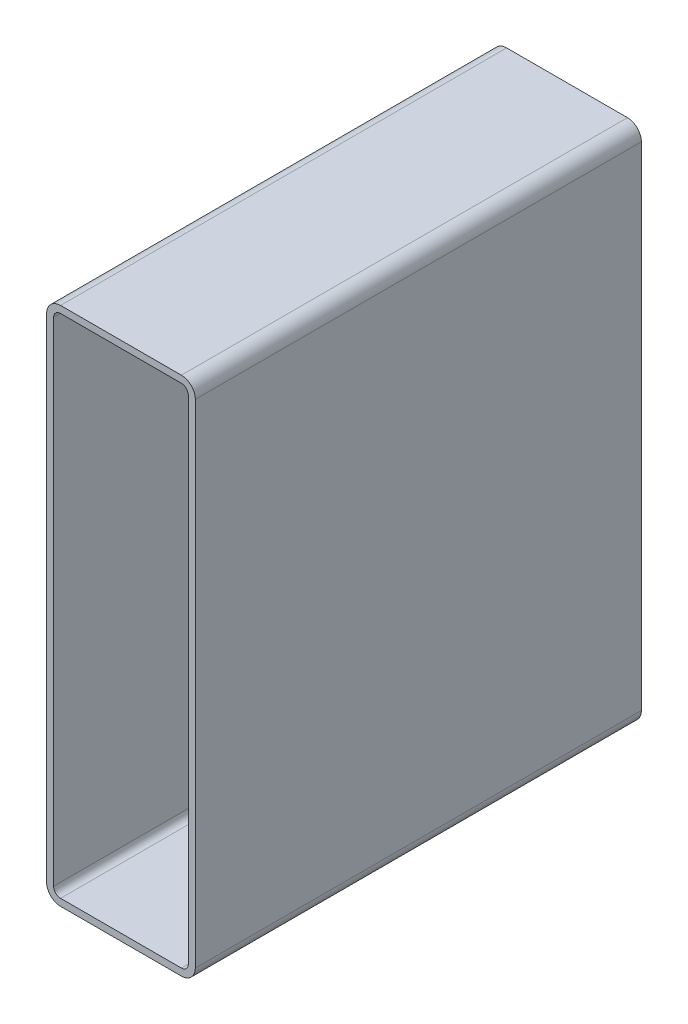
ISO-10303-21;
HEADER;
FILE_DESCRIPTION(('STEP AP214'),'2;1');
FILE_NAME('part.step','',(''),(''),'','','');
FILE_SCHEMA(('AUTOMOTIVE_DESIGN { 1 0 10303 214 1 1 1 1 }'));
ENDSEC;
DATA;
#1=APPLICATION_CONTEXT('core data for automotive mechanical design processes');
#2=APPLICATION_PROTOCOL_DEFINITION('international standard','automotive_design',2000,#1);
#3=PRODUCT_CONTEXT('',#1,'mechanical');
#4=PRODUCT('Part','Part','',(#3));
#5=PRODUCT_RELATED_PRODUCT_CATEGORY('part','',(#4));
#6=PRODUCT_DEFINITION_FORMATION('','',#4);
#7=PRODUCT_DEFINITION_CONTEXT('part definition',#1,'design');
#8=PRODUCT_DEFINITION('design','',#6,#7);
#9=PRODUCT_DEFINITION_SHAPE('','',#8);
#10=(LENGTH_UNIT() NAMED_UNIT(*) SI_UNIT(.MILLI.,.METRE.));
#11=(NAMED_UNIT(*) PLANE_ANGLE_UNIT() SI_UNIT($,.RADIAN.));
#12=(NAMED_UNIT(*) SI_UNIT($,.STERADIAN.) SOLID_ANGLE_UNIT());
#13=UNCERTAINTY_MEASURE_WITH_UNIT(LENGTH_MEASURE(1.E-05),#10,'distance_accuracy_value','');
#14=(GEOMETRIC_REPRESENTATION_CONTEXT(3) GLOBAL_UNCERTAINTY_ASSIGNED_CONTEXT((#13)) GLOBAL_UNIT_ASSIGNED_CONTEXT((#10,
#11,#12)) REPRESENTATION_CONTEXT('',''));
#15=CARTESIAN_POINT('',(0.,0.,0.));
#16=DIRECTION('',(0.,0.,1.));
#17=DIRECTION('',(1.,0.,0.));
#18=AXIS2_PLACEMENT_3D('',#15,#16,#17);
#19=CARTESIAN_POINT('',(11.2001778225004,347.903679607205,304.8));
#20=DIRECTION('',(0.,0.,1.));
#21=DIRECTION('',(1.,0.,0.));
#22=AXIS2_PLACEMENT_3D('',#19,#20,#21);
#23=PLANE('',#22);
#24=CARTESIAN_POINT('',(11.2001778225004,347.903679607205,304.8));
#25=DIRECTION('',(0.,0.,1.));
#26=DIRECTION('',(1.,0.,0.));
#27=AXIS2_PLACEMENT_3D('',#24,#25,#26);
#28=CIRCLE('',#27,9.52500000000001);
#29=CARTESIAN_POINT('',(11.2001778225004,357.428679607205,304.8));
#30=VERTEX_POINT('',#29);
#31=CARTESIAN_POINT('',(1.67517782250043,347.903679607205,304.8));
#32=VERTEX_POINT('',#31);
#33=EDGE_CURVE('E211',#30,#32,#28,.T.);
#34=ORIENTED_EDGE('',*,*,#33,.T.);
#35=DIRECTION('',(0.,-1.,0.));
#36=VECTOR('',#35,1.);
#37=CARTESIAN_POINT('',(1.67517782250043,11.3536796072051,304.8));
#38=LINE('',#37,#36);
#39=CARTESIAN_POINT('',(1.67517782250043,11.3536796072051,304.8));
#40=VERTEX_POINT('',#39);
#41=EDGE_CURVE('E214',#32,#40,#38,.T.);
#42=ORIENTED_EDGE('',*,*,#41,.T.);
#43=CARTESIAN_POINT('',(11.2001778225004,11.3536796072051,304.8));
#44=DIRECTION('',(0.,0.,1.));
#45=DIRECTION('',(1.,0.,0.));
#46=AXIS2_PLACEMENT_3D('',#43,#44,#45);
#47=CIRCLE('',#46,9.525);
#48=CARTESIAN_POINT('',(11.2001778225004,1.82867960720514,304.8));
#49=VERTEX_POINT('',#48);
#50=EDGE_CURVE('E217',#40,#49,#47,.T.);
#51=ORIENTED_EDGE('',*,*,#50,.T.);
#52=DIRECTION('',(1.,0.,0.));
#53=VECTOR('',#52,1.);
#54=CARTESIAN_POINT('',(93.7501778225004,1.82867960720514,304.8));
#55=LINE('',#54,#53);
#56=CARTESIAN_POINT('',(93.7501778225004,1.82867960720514,304.8));
#57=VERTEX_POINT('',#56);
#58=EDGE_CURVE('E219',#49,#57,#55,.T.);
#59=ORIENTED_EDGE('',*,*,#58,.T.);
#60=CARTESIAN_POINT('',(93.7501778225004,11.3536796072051,304.8));
#61=DIRECTION('',(0.,0.,1.));
#62=DIRECTION('',(1.,0.,0.));
#63=AXIS2_PLACEMENT_3D('',#60,#61,#62);
#64=CIRCLE('',#63,9.52500000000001);
#65=CARTESIAN_POINT('',(103.2751778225,11.3536796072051,304.8));
#66=VERTEX_POINT('',#65);
#67=EDGE_CURVE('E221',#57,#66,#64,.T.);
#68=ORIENTED_EDGE('',*,*,#67,.T.);
#69=DIRECTION('',(0.,1.,0.));
#70=VECTOR('',#69,1.);
#71=CARTESIAN_POINT('',(103.2751778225,347.903679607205,304.8));
#72=LINE('',#71,#70);
#73=CARTESIAN_POINT('',(103.2751778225,347.903679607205,304.8));
#74=VERTEX_POINT('',#73);
#75=EDGE_CURVE('E223',#66,#74,#72,.T.);
#76=ORIENTED_EDGE('',*,*,#75,.T.);
#77=CARTESIAN_POINT('',(93.7501778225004,347.903679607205,304.8));
#78=DIRECTION('',(0.,0.,1.));
#79=DIRECTION('',(1.,0.,0.));
#80=AXIS2_PLACEMENT_3D('',#77,#78,#79);
#81=CIRCLE('',#80,9.52500000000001);
#82=CARTESIAN_POINT('',(93.7501778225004,357.428679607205,304.8));
#83=VERTEX_POINT('',#82);
#84=EDGE_CURVE('E225',#74,#83,#81,.T.);
#85=ORIENTED_EDGE('',*,*,#84,.T.);
#86=DIRECTION('',(-1.,0.,0.));
#87=VECTOR('',#86,1.);
#88=CARTESIAN_POINT('',(11.2001778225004,357.428679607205,304.8));
#89=LINE('',#88,#87);
#90=EDGE_CURVE('E227',#83,#30,#89,.T.);
#91=ORIENTED_EDGE('',*,*,#90,.T.);
#92=EDGE_LOOP('',(#34,#42,#51,#59,#68,#76,#85,#91));
#93=FACE_BOUND('',#92,.T.);
#94=DIRECTION('',(0.,-1.,0.));
#95=VECTOR('',#94,1.);
#96=CARTESIAN_POINT('',(6.43767782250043,11.3536796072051,304.8));
#97=LINE('',#96,#95);
#98=CARTESIAN_POINT('',(6.43767782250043,347.903679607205,304.8));
#99=VERTEX_POINT('',#98);
#100=CARTESIAN_POINT('',(6.43767782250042,11.3536796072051,304.8));
#101=VERTEX_POINT('',#100);
#102=EDGE_CURVE('E154',#99,#101,#97,.T.);
#103=ORIENTED_EDGE('',*,*,#102,.F.);
#104=CARTESIAN_POINT('',(11.2001778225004,347.903679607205,304.8));
#105=DIRECTION('',(0.,0.,1.));
#106=DIRECTION('',(1.,0.,0.));
#107=AXIS2_PLACEMENT_3D('',#104,#105,#106);
#108=CIRCLE('',#107,4.76250000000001);
#109=CARTESIAN_POINT('',(11.2001778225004,352.666179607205,304.8));
#110=VERTEX_POINT('',#109);
#111=EDGE_CURVE('E146',#110,#99,#108,.T.);
#112=ORIENTED_EDGE('',*,*,#111,.F.);
#113=DIRECTION('',(-1.,0.,0.));
#114=VECTOR('',#113,1.);
#115=CARTESIAN_POINT('',(11.2001778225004,352.666179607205,304.8));
#116=LINE('',#115,#114);
#117=CARTESIAN_POINT('',(93.7501778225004,352.666179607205,304.8));
#118=VERTEX_POINT('',#117);
#119=EDGE_CURVE('E179',#118,#110,#116,.T.);
#120=ORIENTED_EDGE('',*,*,#119,.F.);
#121=CARTESIAN_POINT('',(93.7501778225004,347.903679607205,304.8));
#122=DIRECTION('',(0.,0.,1.));
#123=DIRECTION('',(1.,0.,0.));
#124=AXIS2_PLACEMENT_3D('',#121,#122,#123);
#125=CIRCLE('',#124,4.7625);
#126=CARTESIAN_POINT('',(98.5126778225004,347.903679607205,304.8));
#127=VERTEX_POINT('',#126);
#128=EDGE_CURVE('E177',#127,#118,#125,.T.);
#129=ORIENTED_EDGE('',*,*,#128,.F.);
#130=DIRECTION('',(0.,1.,0.));
#131=VECTOR('',#130,1.);
#132=CARTESIAN_POINT('',(98.5126778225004,347.903679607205,304.8));
#133=LINE('',#132,#131);
#134=CARTESIAN_POINT('',(98.5126778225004,11.3536796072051,304.8));
#135=VERTEX_POINT('',#134);
#136=EDGE_CURVE('E175',#135,#127,#133,.T.);
#137=ORIENTED_EDGE('',*,*,#136,.F.);
#138=CARTESIAN_POINT('',(93.7501778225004,11.3536796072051,304.8));
#139=DIRECTION('',(0.,0.,1.));
#140=DIRECTION('',(1.,0.,0.));
#141=AXIS2_PLACEMENT_3D('',#138,#139,#140);
#142=CIRCLE('',#141,4.7625);
#143=CARTESIAN_POINT('',(93.7501778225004,6.59117960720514,304.8));
#144=VERTEX_POINT('',#143);
#145=EDGE_CURVE('E173',#144,#135,#142,.T.);
#146=ORIENTED_EDGE('',*,*,#145,.F.);
#147=DIRECTION('',(1.,0.,0.));
#148=VECTOR('',#147,1.);
#149=CARTESIAN_POINT('',(93.7501778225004,6.59117960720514,304.8));
#150=LINE('',#149,#148);
#151=CARTESIAN_POINT('',(11.2001778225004,6.59117960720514,304.8));
#152=VERTEX_POINT('',#151);
#153=EDGE_CURVE('E169',#152,#144,#150,.T.);
#154=ORIENTED_EDGE('',*,*,#153,.F.);
#155=CARTESIAN_POINT('',(11.2001778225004,11.3536796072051,304.8));
#156=DIRECTION('',(0.,0.,1.));
#157=DIRECTION('',(1.,0.,0.));
#158=AXIS2_PLACEMENT_3D('',#155,#156,#157);
#159=CIRCLE('',#158,4.7625);
#160=EDGE_CURVE('E167',#101,#152,#159,.T.);
#161=ORIENTED_EDGE('',*,*,#160,.F.);
#162=EDGE_LOOP('',(#103,#112,#120,#129,#137,#146,#154,#161));
#163=FACE_BOUND('',#162,.T.);
#164=ADVANCED_FACE('F33',(#93,#163),#23,.T.);
#165=CARTESIAN_POINT('',(11.2001778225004,347.903679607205,0.));
#166=DIRECTION('',(0.,0.,1.));
#167=DIRECTION('',(1.,0.,0.));
#168=AXIS2_PLACEMENT_3D('',#165,#166,#167);
#169=PLANE('',#168);
#170=CARTESIAN_POINT('',(11.2001778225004,347.903679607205,0.));
#171=DIRECTION('',(0.,0.,1.));
#172=DIRECTION('',(1.,0.,0.));
#173=AXIS2_PLACEMENT_3D('',#170,#171,#172);
#174=CIRCLE('',#173,9.52500000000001);
#175=CARTESIAN_POINT('',(11.2001778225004,357.428679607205,0.));
#176=VERTEX_POINT('',#175);
#177=CARTESIAN_POINT('',(1.67517782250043,347.903679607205,0.));
#178=VERTEX_POINT('',#177);
#179=EDGE_CURVE('E162',#176,#178,#174,.T.);
#180=ORIENTED_EDGE('',*,*,#179,.F.);
#181=DIRECTION('',(-1.,0.,0.));
#182=VECTOR('',#181,1.);
#183=CARTESIAN_POINT('',(11.2001778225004,357.428679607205,0.));
#184=LINE('',#183,#182);
#185=CARTESIAN_POINT('',(93.7501778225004,357.428679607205,0.));
#186=VERTEX_POINT('',#185);
#187=EDGE_CURVE('E215',#186,#176,#184,.T.);
#188=ORIENTED_EDGE('',*,*,#187,.F.);
#189=CARTESIAN_POINT('',(93.7501778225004,347.903679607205,0.));
#190=DIRECTION('',(0.,0.,1.));
#191=DIRECTION('',(1.,0.,0.));
#192=AXIS2_PLACEMENT_3D('',#189,#190,#191);
#193=CIRCLE('',#192,9.52500000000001);
#194=CARTESIAN_POINT('',(103.2751778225,347.903679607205,0.));
#195=VERTEX_POINT('',#194);
#196=EDGE_CURVE('E242',#195,#186,#193,.T.);
#197=ORIENTED_EDGE('',*,*,#196,.F.);
#198=DIRECTION('',(0.,1.,0.));
#199=VECTOR('',#198,1.);
#200=CARTESIAN_POINT('',(103.2751778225,347.903679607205,0.));
#201=LINE('',#200,#199);
#202=CARTESIAN_POINT('',(103.2751778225,11.3536796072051,0.));
#203=VERTEX_POINT('',#202);
#204=EDGE_CURVE('E240',#203,#195,#201,.T.);
#205=ORIENTED_EDGE('',*,*,#204,.F.);
#206=CARTESIAN_POINT('',(93.7501778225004,11.3536796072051,0.));
#207=DIRECTION('',(0.,0.,1.));
#208=DIRECTION('',(1.,0.,0.));
#209=AXIS2_PLACEMENT_3D('',#206,#207,#208);
#210=CIRCLE('',#209,9.52500000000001);
#211=CARTESIAN_POINT('',(93.7501778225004,1.82867960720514,0.));
#212=VERTEX_POINT('',#211);
#213=EDGE_CURVE('E238',#212,#203,#210,.T.);
#214=ORIENTED_EDGE('',*,*,#213,.F.);
#215=DIRECTION('',(1.,0.,0.));
#216=VECTOR('',#215,1.);
#217=CARTESIAN_POINT('',(93.7501778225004,1.82867960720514,0.));
#218=LINE('',#217,#216);
#219=CARTESIAN_POINT('',(11.2001778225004,1.82867960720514,0.));
#220=VERTEX_POINT('',#219);
#221=EDGE_CURVE('E236',#220,#212,#218,.T.);
#222=ORIENTED_EDGE('',*,*,#221,.F.);
#223=CARTESIAN_POINT('',(11.2001778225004,11.3536796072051,0.));
#224=DIRECTION('',(0.,0.,1.));
#225=DIRECTION('',(1.,0.,0.));
#226=AXIS2_PLACEMENT_3D('',#223,#224,#225);
#227=CIRCLE('',#226,9.525);
#228=CARTESIAN_POINT('',(1.67517782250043,11.3536796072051,0.));
#229=VERTEX_POINT('',#228);
#230=EDGE_CURVE('E234',#229,#220,#227,.T.);
#231=ORIENTED_EDGE('',*,*,#230,.F.);
#232=DIRECTION('',(0.,-1.,0.));
#233=VECTOR('',#232,1.);
#234=CARTESIAN_POINT('',(1.67517782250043,11.3536796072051,0.));
#235=LINE('',#234,#233);
#236=EDGE_CURVE('E232',#178,#229,#235,.T.);
#237=ORIENTED_EDGE('',*,*,#236,.F.);
#238=EDGE_LOOP('',(#180,#188,#197,#205,#214,#222,#231,#237));
#239=FACE_BOUND('',#238,.T.);
#240=CARTESIAN_POINT('',(11.2001778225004,347.903679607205,0.));
#241=DIRECTION('',(0.,0.,1.));
#242=DIRECTION('',(1.,0.,0.));
#243=AXIS2_PLACEMENT_3D('',#240,#241,#242);
#244=CIRCLE('',#243,4.76250000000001);
#245=CARTESIAN_POINT('',(11.2001778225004,352.666179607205,0.));
#246=VERTEX_POINT('',#245);
#247=CARTESIAN_POINT('',(6.43767782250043,347.903679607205,0.));
#248=VERTEX_POINT('',#247);
#249=EDGE_CURVE('E56',#246,#248,#244,.T.);
#250=ORIENTED_EDGE('',*,*,#249,.T.);
#251=DIRECTION('',(0.,-1.,0.));
#252=VECTOR('',#251,1.);
#253=CARTESIAN_POINT('',(6.43767782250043,11.3536796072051,0.));
#254=LINE('',#253,#252);
#255=CARTESIAN_POINT('',(6.43767782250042,11.3536796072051,0.));
#256=VERTEX_POINT('',#255);
#257=EDGE_CURVE('E161',#248,#256,#254,.T.);
#258=ORIENTED_EDGE('',*,*,#257,.T.);
#259=CARTESIAN_POINT('',(11.2001778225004,11.3536796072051,0.));
#260=DIRECTION('',(0.,0.,1.));
#261=DIRECTION('',(1.,0.,0.));
#262=AXIS2_PLACEMENT_3D('',#259,#260,#261);
#263=CIRCLE('',#262,4.7625);
#264=CARTESIAN_POINT('',(11.2001778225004,6.59117960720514,0.));
#265=VERTEX_POINT('',#264);
#266=EDGE_CURVE('E183',#256,#265,#263,.T.);
#267=ORIENTED_EDGE('',*,*,#266,.T.);
#268=DIRECTION('',(1.,0.,0.));
#269=VECTOR('',#268,1.);
#270=CARTESIAN_POINT('',(93.7501778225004,6.59117960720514,0.));
#271=LINE('',#270,#269);
#272=CARTESIAN_POINT('',(93.7501778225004,6.59117960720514,0.));
#273=VERTEX_POINT('',#272);
#274=EDGE_CURVE('E186',#265,#273,#271,.T.);
#275=ORIENTED_EDGE('',*,*,#274,.T.);
#276=CARTESIAN_POINT('',(93.7501778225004,11.3536796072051,0.));
#277=DIRECTION('',(0.,0.,1.));
#278=DIRECTION('',(1.,0.,0.));
#279=AXIS2_PLACEMENT_3D('',#276,#277,#278);
#280=CIRCLE('',#279,4.7625);
#281=CARTESIAN_POINT('',(98.5126778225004,11.3536796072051,0.));
#282=VERTEX_POINT('',#281);
#283=EDGE_CURVE('E189',#273,#282,#280,.T.);
#284=ORIENTED_EDGE('',*,*,#283,.T.);
#285=DIRECTION('',(0.,1.,0.));
#286=VECTOR('',#285,1.);
#287=CARTESIAN_POINT('',(98.5126778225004,347.903679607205,0.));
#288=LINE('',#287,#286);
#289=CARTESIAN_POINT('',(98.5126778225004,347.903679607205,0.));
#290=VERTEX_POINT('',#289);
#291=EDGE_CURVE('E192',#282,#290,#288,.T.);
#292=ORIENTED_EDGE('',*,*,#291,.T.);
#293=CARTESIAN_POINT('',(93.7501778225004,347.903679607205,0.));
#294=DIRECTION('',(0.,0.,1.));
#295=DIRECTION('',(1.,0.,0.));
#296=AXIS2_PLACEMENT_3D('',#293,#294,#295);
#297=CIRCLE('',#296,4.7625);
#298=CARTESIAN_POINT('',(93.7501778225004,352.666179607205,0.));
#299=VERTEX_POINT('',#298);
#300=EDGE_CURVE('E195',#290,#299,#297,.T.);
#301=ORIENTED_EDGE('',*,*,#300,.T.);
#302=DIRECTION('',(-1.,0.,0.));
#303=VECTOR('',#302,1.);
#304=CARTESIAN_POINT('',(11.2001778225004,352.666179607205,0.));
#305=LINE('',#304,#303);
#306=EDGE_CURVE('E155',#299,#246,#305,.T.);
#307=ORIENTED_EDGE('',*,*,#306,.T.);
#308=EDGE_LOOP('',(#250,#258,#267,#275,#284,#292,#301,#307));
#309=FACE_BOUND('',#308,.T.);
#310=ADVANCED_FACE('F272',(#239,#309),#169,.F.);
#311=CARTESIAN_POINT('',(11.2001778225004,347.903679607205,304.8));
#312=DIRECTION('',(0.,0.,-1.));
#313=DIRECTION('',(-1.,0.,0.));
#314=AXIS2_PLACEMENT_3D('',#311,#312,#313);
#315=CYLINDRICAL_SURFACE('',#314,9.52500000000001);
#316=ORIENTED_EDGE('',*,*,#179,.T.);
#317=DIRECTION('',(0.,0.,-1.));
#318=VECTOR('',#317,1.);
#319=CARTESIAN_POINT('',(1.67517782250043,347.903679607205,304.8));
#320=LINE('',#319,#318);
#321=EDGE_CURVE('E11',#32,#178,#320,.T.);
#322=ORIENTED_EDGE('',*,*,#321,.F.);
#323=ORIENTED_EDGE('',*,*,#33,.F.);
#324=DIRECTION('',(0.,0.,-1.));
#325=VECTOR('',#324,1.);
#326=CARTESIAN_POINT('',(11.2001778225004,357.428679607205,304.8));
#327=LINE('',#326,#325);
#328=EDGE_CURVE('E229',#30,#176,#327,.T.);
#329=ORIENTED_EDGE('',*,*,#328,.T.);
#330=EDGE_LOOP('',(#316,#322,#323,#329));
#331=FACE_BOUND('',#330,.T.);
#332=ADVANCED_FACE('F35',(#331),#315,.T.);
#333=CARTESIAN_POINT('',(1.67517782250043,11.3536796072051,304.8));
#334=DIRECTION('',(1.,0.,0.));
#335=DIRECTION('',(0.,0.,-1.));
#336=AXIS2_PLACEMENT_3D('',#333,#334,#335);
#337=PLANE('',#336);
#338=ORIENTED_EDGE('',*,*,#236,.T.);
#339=DIRECTION('',(0.,0.,-1.));
#340=VECTOR('',#339,1.);
#341=CARTESIAN_POINT('',(1.67517782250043,11.3536796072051,304.8));
#342=LINE('',#341,#340);
#343=EDGE_CURVE('E41',#40,#229,#342,.T.);
#344=ORIENTED_EDGE('',*,*,#343,.F.);
#345=ORIENTED_EDGE('',*,*,#41,.F.);
#346=ORIENTED_EDGE('',*,*,#321,.T.);
#347=EDGE_LOOP('',(#338,#344,#345,#346));
#348=FACE_BOUND('',#347,.T.);
#349=ADVANCED_FACE('F289',(#348),#337,.F.);
#350=CARTESIAN_POINT('',(11.2001778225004,11.3536796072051,304.8));
#351=DIRECTION('',(0.,0.,-1.));
#352=DIRECTION('',(-1.,0.,0.));
#353=AXIS2_PLACEMENT_3D('',#350,#351,#352);
#354=CYLINDRICAL_SURFACE('',#353,9.525);
#355=ORIENTED_EDGE('',*,*,#230,.T.);
#356=DIRECTION('',(0.,0.,-1.));
#357=VECTOR('',#356,1.);
#358=CARTESIAN_POINT('',(11.2001778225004,1.82867960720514,304.8));
#359=LINE('',#358,#357);
#360=EDGE_CURVE('E259',#49,#220,#359,.T.);
#361=ORIENTED_EDGE('',*,*,#360,.F.);
#362=ORIENTED_EDGE('',*,*,#50,.F.);
#363=ORIENTED_EDGE('',*,*,#343,.T.);
#364=EDGE_LOOP('',(#355,#361,#362,#363));
#365=FACE_BOUND('',#364,.T.);
#366=ADVANCED_FACE('F266',(#365),#354,.T.);
#367=CARTESIAN_POINT('',(93.7501778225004,1.82867960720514,304.8));
#368=DIRECTION('',(0.,1.,0.));
#369=DIRECTION('',(0.,0.,1.));
#370=AXIS2_PLACEMENT_3D('',#367,#368,#369);
#371=PLANE('',#370);
#372=ORIENTED_EDGE('',*,*,#221,.T.);
#373=DIRECTION('',(0.,0.,-1.));
#374=VECTOR('',#373,1.);
#375=CARTESIAN_POINT('',(93.7501778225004,1.82867960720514,304.8));
#376=LINE('',#375,#374);
#377=EDGE_CURVE('E256',#57,#212,#376,.T.);
#378=ORIENTED_EDGE('',*,*,#377,.F.);
#379=ORIENTED_EDGE('',*,*,#58,.F.);
#380=ORIENTED_EDGE('',*,*,#360,.T.);
#381=EDGE_LOOP('',(#372,#378,#379,#380));
#382=FACE_BOUND('',#381,.T.);
#383=ADVANCED_FACE('F278',(#382),#371,.F.);
#384=CARTESIAN_POINT('',(93.7501778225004,11.3536796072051,304.8));
#385=DIRECTION('',(0.,0.,-1.));
#386=DIRECTION('',(-1.,0.,0.));
#387=AXIS2_PLACEMENT_3D('',#384,#385,#386);
#388=CYLINDRICAL_SURFACE('',#387,9.52500000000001);
#389=ORIENTED_EDGE('',*,*,#213,.T.);
#390=DIRECTION('',(0.,0.,-1.));
#391=VECTOR('',#390,1.);
#392=CARTESIAN_POINT('',(103.2751778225,11.3536796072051,304.8));
#393=LINE('',#392,#391);
#394=EDGE_CURVE('E253',#66,#203,#393,.T.);
#395=ORIENTED_EDGE('',*,*,#394,.F.);
#396=ORIENTED_EDGE('',*,*,#67,.F.);
#397=ORIENTED_EDGE('',*,*,#377,.T.);
#398=EDGE_LOOP('',(#389,#395,#396,#397));
#399=FACE_BOUND('',#398,.T.);
#400=ADVANCED_FACE('F282',(#399),#388,.T.);
#401=CARTESIAN_POINT('',(103.2751778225,347.903679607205,304.8));
#402=DIRECTION('',(-1.,0.,0.));
#403=DIRECTION('',(0.,0.,1.));
#404=AXIS2_PLACEMENT_3D('',#401,#402,#403);
#405=PLANE('',#404);
#406=ORIENTED_EDGE('',*,*,#204,.T.);
#407=DIRECTION('',(0.,0.,-1.));
#408=VECTOR('',#407,1.);
#409=CARTESIAN_POINT('',(103.2751778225,347.903679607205,304.8));
#410=LINE('',#409,#408);
#411=EDGE_CURVE('E250',#74,#195,#410,.T.);
#412=ORIENTED_EDGE('',*,*,#411,.F.);
#413=ORIENTED_EDGE('',*,*,#75,.F.);
#414=ORIENTED_EDGE('',*,*,#394,.T.);
#415=EDGE_LOOP('',(#406,#412,#413,#414));
#416=FACE_BOUND('',#415,.T.);
#417=ADVANCED_FACE('F302',(#416),#405,.F.);
#418=CARTESIAN_POINT('',(93.7501778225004,347.903679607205,304.8));
#419=DIRECTION('',(0.,0.,-1.));
#420=DIRECTION('',(-1.,0.,0.));
#421=AXIS2_PLACEMENT_3D('',#418,#419,#420);
#422=CYLINDRICAL_SURFACE('',#421,9.52500000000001);
#423=ORIENTED_EDGE('',*,*,#196,.T.);
#424=DIRECTION('',(0.,0.,-1.));
#425=VECTOR('',#424,1.);
#426=CARTESIAN_POINT('',(93.7501778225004,357.428679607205,304.8));
#427=LINE('',#426,#425);
#428=EDGE_CURVE('E247',#83,#186,#427,.T.);
#429=ORIENTED_EDGE('',*,*,#428,.F.);
#430=ORIENTED_EDGE('',*,*,#84,.F.);
#431=ORIENTED_EDGE('',*,*,#411,.T.);
#432=EDGE_LOOP('',(#423,#429,#430,#431));
#433=FACE_BOUND('',#432,.T.);
#434=ADVANCED_FACE('F300',(#433),#422,.T.);
#435=CARTESIAN_POINT('',(11.2001778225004,357.428679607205,304.8));
#436=DIRECTION('',(0.,-1.,0.));
#437=DIRECTION('',(0.,0.,-1.));
#438=AXIS2_PLACEMENT_3D('',#435,#436,#437);
#439=PLANE('',#438);
#440=ORIENTED_EDGE('',*,*,#187,.T.);
#441=ORIENTED_EDGE('',*,*,#328,.F.);
#442=ORIENTED_EDGE('',*,*,#90,.F.);
#443=ORIENTED_EDGE('',*,*,#428,.T.);
#444=EDGE_LOOP('',(#440,#441,#442,#443));
#445=FACE_BOUND('',#444,.T.);
#446=ADVANCED_FACE('F295',(#445),#439,.F.);
#447=CARTESIAN_POINT('',(11.2001778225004,347.903679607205,304.8));
#448=DIRECTION('',(0.,0.,-1.));
#449=DIRECTION('',(-1.,0.,0.));
#450=AXIS2_PLACEMENT_3D('',#447,#448,#449);
#451=CYLINDRICAL_SURFACE('',#450,4.76250000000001);
#452=ORIENTED_EDGE('',*,*,#249,.F.);
#453=DIRECTION('',(0.,0.,-1.));
#454=VECTOR('',#453,1.);
#455=CARTESIAN_POINT('',(11.2001778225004,352.666179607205,304.8));
#456=LINE('',#455,#454);
#457=EDGE_CURVE('E150',#110,#246,#456,.T.);
#458=ORIENTED_EDGE('',*,*,#457,.F.);
#459=ORIENTED_EDGE('',*,*,#111,.T.);
#460=DIRECTION('',(0.,0.,-1.));
#461=VECTOR('',#460,1.);
#462=CARTESIAN_POINT('',(6.43767782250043,347.903679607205,304.8));
#463=LINE('',#462,#461);
#464=EDGE_CURVE('E149',#99,#248,#463,.T.);
#465=ORIENTED_EDGE('',*,*,#464,.T.);
#466=EDGE_LOOP('',(#452,#458,#459,#465));
#467=FACE_BOUND('',#466,.T.);
#468=ADVANCED_FACE('F148',(#467),#451,.F.);
#469=CARTESIAN_POINT('',(6.43767782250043,11.3536796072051,304.8));
#470=DIRECTION('',(1.,0.,0.));
#471=DIRECTION('',(0.,0.,-1.));
#472=AXIS2_PLACEMENT_3D('',#469,#470,#471);
#473=PLANE('',#472);
#474=ORIENTED_EDGE('',*,*,#257,.F.);
#475=ORIENTED_EDGE('',*,*,#464,.F.);
#476=ORIENTED_EDGE('',*,*,#102,.T.);
#477=DIRECTION('',(0.,0.,-1.));
#478=VECTOR('',#477,1.);
#479=CARTESIAN_POINT('',(6.43767782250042,11.3536796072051,304.8));
#480=LINE('',#479,#478);
#481=EDGE_CURVE('E163',#101,#256,#480,.T.);
#482=ORIENTED_EDGE('',*,*,#481,.T.);
#483=EDGE_LOOP('',(#474,#475,#476,#482));
#484=FACE_BOUND('',#483,.T.);
#485=ADVANCED_FACE('F158',(#484),#473,.T.);
#486=CARTESIAN_POINT('',(11.2001778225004,11.3536796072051,304.8));
#487=DIRECTION('',(0.,0.,-1.));
#488=DIRECTION('',(-1.,0.,0.));
#489=AXIS2_PLACEMENT_3D('',#486,#487,#488);
#490=CYLINDRICAL_SURFACE('',#489,4.7625);
#491=ORIENTED_EDGE('',*,*,#266,.F.);
#492=ORIENTED_EDGE('',*,*,#481,.F.);
#493=ORIENTED_EDGE('',*,*,#160,.T.);
#494=DIRECTION('',(0.,0.,-1.));
#495=VECTOR('',#494,1.);
#496=CARTESIAN_POINT('',(11.2001778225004,6.59117960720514,304.8));
#497=LINE('',#496,#495);
#498=EDGE_CURVE('E208',#152,#265,#497,.T.);
#499=ORIENTED_EDGE('',*,*,#498,.T.);
#500=EDGE_LOOP('',(#491,#492,#493,#499));
#501=FACE_BOUND('',#500,.T.);
#502=ADVANCED_FACE('F327',(#501),#490,.F.);
#503=CARTESIAN_POINT('',(93.7501778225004,6.59117960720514,304.8));
#504=DIRECTION('',(0.,1.,0.));
#505=DIRECTION('',(0.,0.,1.));
#506=AXIS2_PLACEMENT_3D('',#503,#504,#505);
#507=PLANE('',#506);
#508=ORIENTED_EDGE('',*,*,#274,.F.);
#509=ORIENTED_EDGE('',*,*,#498,.F.);
#510=ORIENTED_EDGE('',*,*,#153,.T.);
#511=DIRECTION('',(0.,0.,-1.));
#512=VECTOR('',#511,1.);
#513=CARTESIAN_POINT('',(93.7501778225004,6.59117960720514,304.8));
#514=LINE('',#513,#512);
#515=EDGE_CURVE('E206',#144,#273,#514,.T.);
#516=ORIENTED_EDGE('',*,*,#515,.T.);
#517=EDGE_LOOP('',(#508,#509,#510,#516));
#518=FACE_BOUND('',#517,.T.);
#519=ADVANCED_FACE('F331',(#518),#507,.T.);
#520=CARTESIAN_POINT('',(93.7501778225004,11.3536796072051,304.8));
#521=DIRECTION('',(0.,0.,-1.));
#522=DIRECTION('',(-1.,0.,0.));
#523=AXIS2_PLACEMENT_3D('',#520,#521,#522);
#524=CYLINDRICAL_SURFACE('',#523,4.7625);
#525=ORIENTED_EDGE('',*,*,#283,.F.);
#526=ORIENTED_EDGE('',*,*,#515,.F.);
#527=ORIENTED_EDGE('',*,*,#145,.T.);
#528=DIRECTION('',(0.,0.,-1.));
#529=VECTOR('',#528,1.);
#530=CARTESIAN_POINT('',(98.5126778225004,11.3536796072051,304.8));
#531=LINE('',#530,#529);
#532=EDGE_CURVE('E204',#135,#282,#531,.T.);
#533=ORIENTED_EDGE('',*,*,#532,.T.);
#534=EDGE_LOOP('',(#525,#526,#527,#533));
#535=FACE_BOUND('',#534,.T.);
#536=ADVANCED_FACE('F337',(#535),#524,.F.);
#537=CARTESIAN_POINT('',(98.5126778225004,347.903679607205,304.8));
#538=DIRECTION('',(-1.,0.,0.));
#539=DIRECTION('',(0.,0.,1.));
#540=AXIS2_PLACEMENT_3D('',#537,#538,#539);
#541=PLANE('',#540);
#542=ORIENTED_EDGE('',*,*,#291,.F.);
#543=ORIENTED_EDGE('',*,*,#532,.F.);
#544=ORIENTED_EDGE('',*,*,#136,.T.);
#545=DIRECTION('',(0.,0.,-1.));
#546=VECTOR('',#545,1.);
#547=CARTESIAN_POINT('',(98.5126778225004,347.903679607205,304.8));
#548=LINE('',#547,#546);
#549=EDGE_CURVE('E202',#127,#290,#548,.T.);
#550=ORIENTED_EDGE('',*,*,#549,.T.);
#551=EDGE_LOOP('',(#542,#543,#544,#550));
#552=FACE_BOUND('',#551,.T.);
#553=ADVANCED_FACE('F341',(#552),#541,.T.);
#554=CARTESIAN_POINT('',(93.7501778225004,347.903679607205,304.8));
#555=DIRECTION('',(0.,0.,-1.));
#556=DIRECTION('',(-1.,0.,0.));
#557=AXIS2_PLACEMENT_3D('',#554,#555,#556);
#558=CYLINDRICAL_SURFACE('',#557,4.7625);
#559=ORIENTED_EDGE('',*,*,#300,.F.);
#560=ORIENTED_EDGE('',*,*,#549,.F.);
#561=ORIENTED_EDGE('',*,*,#128,.T.);
#562=DIRECTION('',(0.,0.,-1.));
#563=VECTOR('',#562,1.);
#564=CARTESIAN_POINT('',(93.7501778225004,352.666179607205,304.8));
#565=LINE('',#564,#563);
#566=EDGE_CURVE('E48',#118,#299,#565,.T.);
#567=ORIENTED_EDGE('',*,*,#566,.T.);
#568=EDGE_LOOP('',(#559,#560,#561,#567));
#569=FACE_BOUND('',#568,.T.);
#570=ADVANCED_FACE('F345',(#569),#558,.F.);
#571=CARTESIAN_POINT('',(11.2001778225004,352.666179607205,304.8));
#572=DIRECTION('',(0.,-1.,0.));
#573=DIRECTION('',(0.,0.,-1.));
#574=AXIS2_PLACEMENT_3D('',#571,#572,#573);
#575=PLANE('',#574);
#576=ORIENTED_EDGE('',*,*,#306,.F.);
#577=ORIENTED_EDGE('',*,*,#566,.F.);
#578=ORIENTED_EDGE('',*,*,#119,.T.);
#579=ORIENTED_EDGE('',*,*,#457,.T.);
#580=EDGE_LOOP('',(#576,#577,#578,#579));
#581=FACE_BOUND('',#580,.T.);
#582=ADVANCED_FACE('F349',(#581),#575,.T.);
#583=CLOSED_SHELL('',(#164,#310,#332,#349,#366,#383,#400,#417,#434,#446,#468,#485,#502,#519,
#536,#553,#570,#582));
#584=MANIFOLD_SOLID_BREP('B2',#583);
#585=ADVANCED_BREP_SHAPE_REPRESENTATION('',(#18,#584),#14);
#586=SHAPE_DEFINITION_REPRESENTATION(#9,#585);
ENDSEC;
END-ISO-10303-21;
